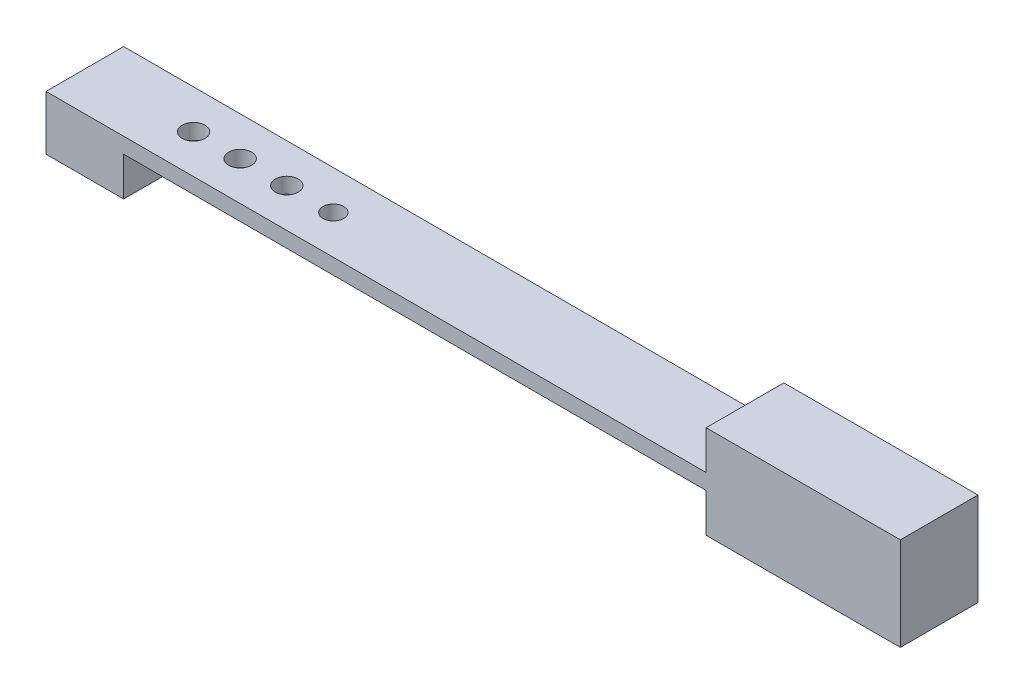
from build123d import *

# Parameters (mm, degrees)
SKETCH1_W           = 220
SKETCH1_H           = 20
BOSS_EXTRUDE1_DEPTH = 4
SKETCH2_R           = 2.95
SKETCH2_R_2         = 2.675456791
CUT_EXTRUDE1_DEPTH  = 4
SKETCH3_W           = 50
SKETCH3_H           = 20
BOSS_EXTRUDE2_DEPTH = 10
SKETCH4_W           = 50
SKETCH4_H           = 20
BOSS_EXTRUDE3_DEPTH = 10
SKETCH5_W           = 20
SKETCH5_H           = 20
BOSS_EXTRUDE4_DEPTH = 10


with BuildPart() as part:
    # Sketch1 → Boss-Extrude1 (new body)
    with BuildSketch(Plane(origin=(0, 0, 0), x_dir=(1, 0, 0), z_dir=(0, 1, 0))):
        Rectangle(SKETCH1_W, SKETCH1_H)
    extrude(amount=BOSS_EXTRUDE1_DEPTH)

    # Sketch2 → Cut-Extrude1 (cut)
    with BuildSketch(Plane(origin=(0, 4, 0), x_dir=(1, 0, 0), z_dir=(0, 1, 0))):
        with Locations(Location((-70, 0, 0), (0, 0, 270))):
            Circle(SKETCH2_R)
        with Locations(Location((-58, 0, 0), (0, 0, 270))):
            Circle(SKETCH2_R)
        with Locations(Location((-46, 0, 0), (0, 0, 270))):
            Circle(SKETCH2_R_2)
        with Locations(Location((-82, 0, 0), (0, 0, 270))):
            Circle(SKETCH2_R)
    extrude(amount=-CUT_EXTRUDE1_DEPTH, mode=Mode.SUBTRACT)

    # Sketch3 → Boss-Extrude2 (add)
    with BuildSketch(Plane(origin=(0, 4, 0), x_dir=(1, 0, 0), z_dir=(0, 1, 0))):
        with Locations((85, 0)):
            Rectangle(SKETCH3_W, SKETCH3_H)
    extrude(amount=BOSS_EXTRUDE2_DEPTH)

    # Sketch4 → Boss-Extrude3 (add)
    with BuildSketch(Plane.XZ):
        with Locations((85, 0)):
            Rectangle(SKETCH4_W, SKETCH4_H)
    extrude(amount=BOSS_EXTRUDE3_DEPTH)

    # Sketch5 → Boss-Extrude4 (add)
    with BuildSketch(Plane.XZ):
        with Locations((-100, 0)):
            Rectangle(SKETCH5_W, SKETCH5_H)
    extrude(amount=BOSS_EXTRUDE4_DEPTH)


solid = part.part
